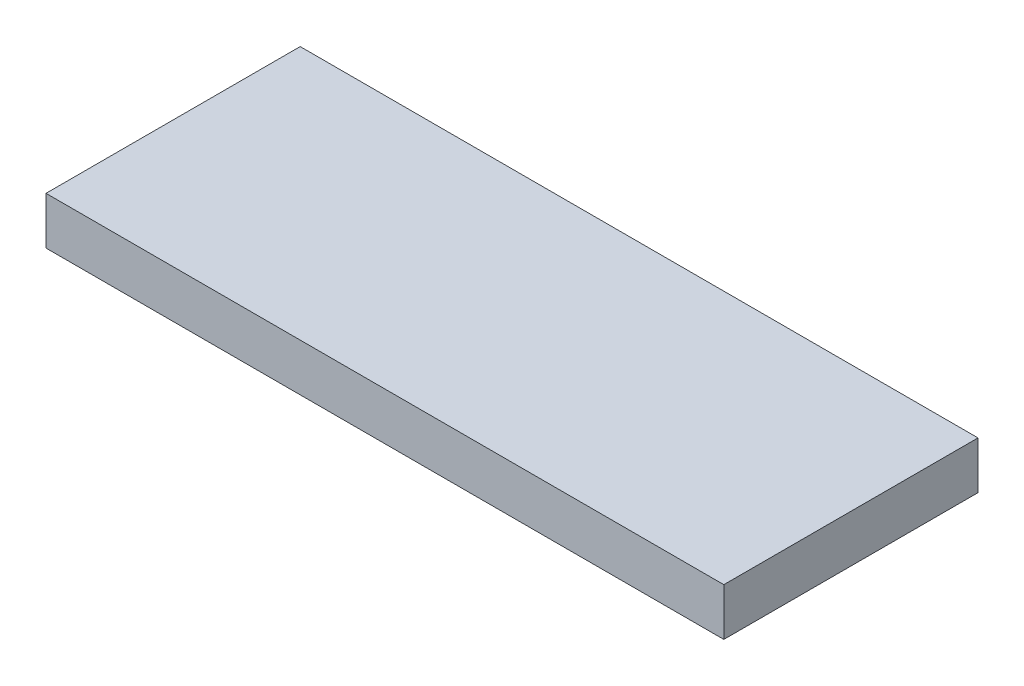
from build123d import *

# Parameters (mm, degrees)
SKETCH1_W           = 40
SKETCH1_H           = 15
BOSS_EXTRUDE1_DEPTH = 2.8


with BuildPart() as part:
    # Sketch1 → Boss-Extrude1 (new body)
    with BuildSketch(Plane(origin=(0, 0, 0), x_dir=(1, 0, 0), z_dir=(0, 1, 0))):
        with Locations((20, 7.5)):
            Rectangle(SKETCH1_W, SKETCH1_H)
    extrude(amount=BOSS_EXTRUDE1_DEPTH)


solid = part.part
